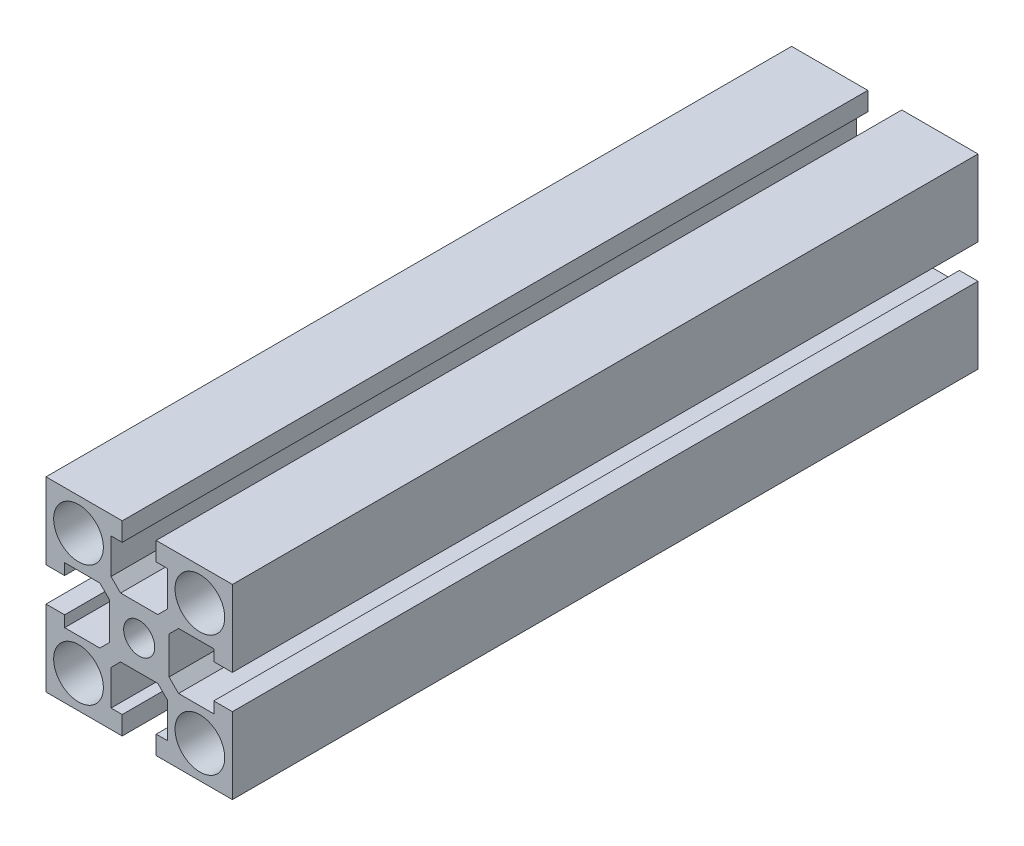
from build123d import *

# Parameters (mm, degrees)
EXTRUDE1_DEPTH           = 90
EXTRUDE1_DEPTH_BACK      = 90
SKETCH1_R                = 6
SKETCH1_R_2              = 3.75
F_7_0_7_DIAMETER_HOLE1_D = 7


with BuildPart() as part:
    # Sketch1 → Extrude1 (new, two sides: drawn at the far end of the back side and taken through both)
    with BuildSketch(Plane.XY.offset(-EXTRUDE1_DEPTH_BACK)):
        Polygon((-18, -4.1), (-22.5, -4.1), (-22.5, -22.5), (-4.1, -22.5), (-4.1, -18), (-6.8, -18), (-6.8, -9.5), (-4.5, -7.2), (4.5, -7.2), (6.8, -9.5), (6.8, -18), (4.1, -18), (4.1, -22.5), (22.5, -22.5), (22.5, -4.1), (18, -4.1), (18, -6.8), (9.5, -6.8), (7.2, -4.5), (7.2, 4.5), (9.5, 6.8), (18, 6.8), (18, 4.1), (22.5, 4.1), (22.5, 22.5), (4.1, 22.5), (4.1, 18), (6.8, 18), (6.8, 9.5), (4.5, 7.2), (-4.5, 7.2), (-6.8, 9.5), (-6.8, 18), (-4.1, 18), (-4.1, 22.5), (-22.5, 22.5), (-22.5, 4.1), (-18, 4.1), (-18, 6.8), (-9.5, 6.8), (-7.2, 4.5), (-7.2, -4.5), (-9.5, -6.8), (-18, -6.8), align=None)
        with Locations((14.65, -14.65)):
            Circle(SKETCH1_R, mode=Mode.SUBTRACT)
        with Locations((-14.65, -14.65)):
            Circle(SKETCH1_R, mode=Mode.SUBTRACT)
        Circle(SKETCH1_R_2, mode=Mode.SUBTRACT)
        with Locations((14.65, 14.65)):
            Circle(SKETCH1_R, mode=Mode.SUBTRACT)
        with Locations((-14.65, 14.65)):
            Circle(SKETCH1_R, mode=Mode.SUBTRACT)
    extrude(amount=EXTRUDE1_DEPTH + EXTRUDE1_DEPTH_BACK)

    # 7.0 _7_ Diameter Hole1 (through all)
    with Locations(Plane(origin=(-22.5, 0, -67.5), x_dir=(0, -1, 0), z_dir=(-1, 0, 0))):
        with Locations((0, 0), (0, 45), (0, 90), (0, 135)):
            Hole(F_7_0_7_DIAMETER_HOLE1_D / 2)


solid = part.part
